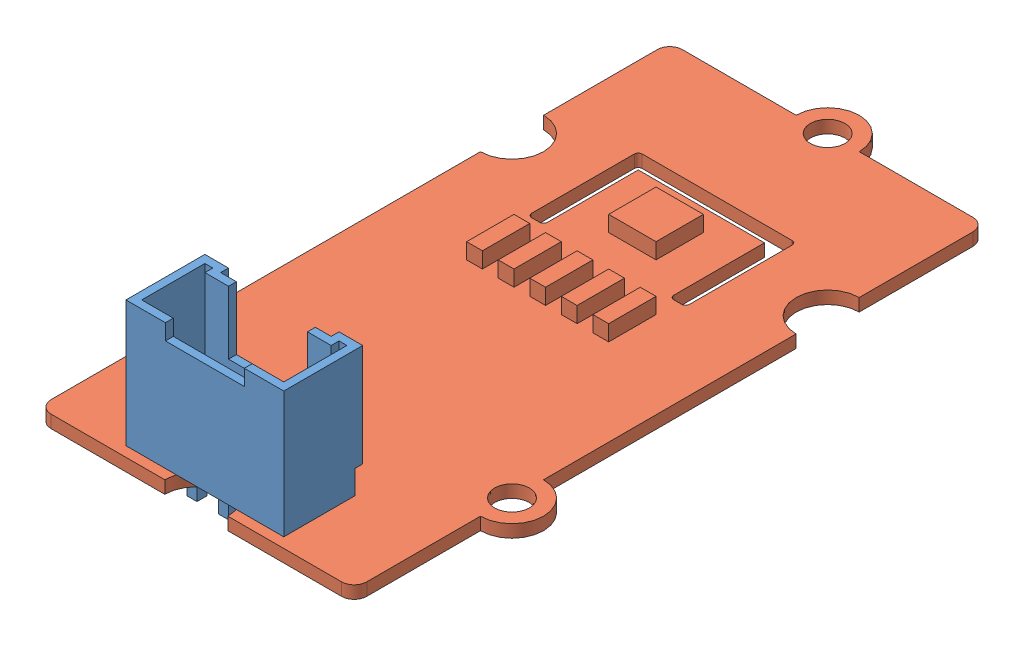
SolidWorks assembly SHT35 board.SLDASM, configuration Default (file format 11000). Lengths in mm.
Overall size (24 11 42).
2 component instances, 2 part files, 2 mates.
Components (placement in the parent):
- Grove socket-1: Grove socket.SLDPRT [Default] at (14.103 13.8423 41.3271) x (-1 0 0) z (0 0 -1) size (10 11 5)
- SHT31 sensor board-2: SHT31 sensor board.SLDPRT [Default] at (-0.8008 13.0423 46.9639) size (24 1.8 42)
Mates (geometry in assembly coordinates):
- Parallel4: parallel: plane of SHT31 sensor board-2 through (11.1992 13.8423 46.9639) normal (0 0 1); plane of Grove socket-1 through (14.103 21.8423 46.3271) normal (0 0 1)
- Coincident48: coincident: plane of SHT31 sensor board-2 through (-0.0008 13.8423 46.1639) normal (0 1 0); plane of Grove socket-1 through (14.103 13.8423 41.3271) normal (0 -1 0)
